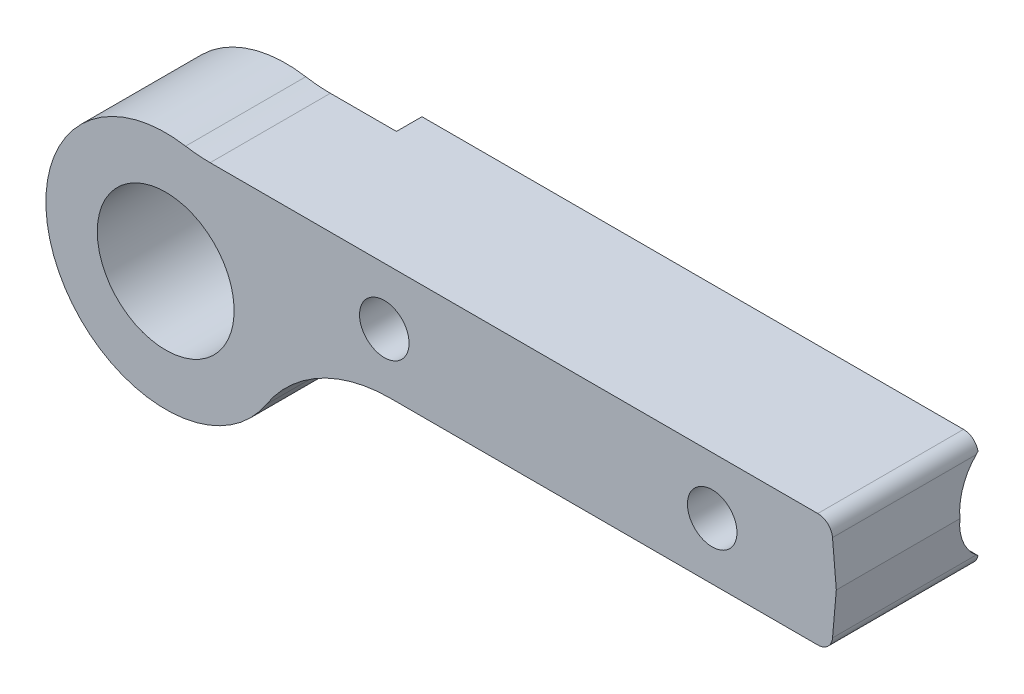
from build123d import *

# Parameters (mm, degrees)
BASE_EXTRUSION_DEPTH    = 20
ESQUISSE3_R             = 22
ENL_V_MAT_EXTRU_1_DEPTH = 3.5
ESQUISSE4_R             = 7.815
ENL_V_MAT_EXTRU_2_DEPTH = 115.413399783
ESQUISSE5_R             = 9.39
ENL_V_MAT_EXTRU_3_DEPTH = 95.936264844
TROU_TARAUD_M8X1_252_D  = 6.8


with BuildPart() as part:
    # Esquisse1 → Base-Extrusion (new body)
    with BuildSketch(Plane.XY):
        with BuildLine():
            Line((6.100803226, 15.935), (89.489847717, 15.935))
            ThreePointArc((89.489847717, 15.935), (90.861295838, 15.401672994), (91.512122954, 14.081926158))
            Line((91.512122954, 14.081926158), (92.033723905, 8.12))
            Line((92.033723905, 8.12), (91.512122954, 2.158073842))
            ThreePointArc((91.512122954, 2.158073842), (90.861295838, 0.838327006), (89.489847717, 0.305))
            Line((89.489847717, 0.305), (30.828477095, 0.305))
            ThreePointArc((30.828477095, 0.305), (21.137014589, -2.157804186), (13.797096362, -8.948639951))
            ThreePointArc((13.797096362, -8.948639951), (-15.053690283, -6.620002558), (2.730377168, 16.216752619))
            ThreePointArc((2.730377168, 16.216752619), (4.409712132, 16.005560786), (6.100803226, 15.935))
        make_face()
    extrude(amount=BASE_EXTRUSION_DEPTH)

    # Esquisse3 → Enl_v. mat.-Extru.1 (cut)
    with BuildSketch(Plane(origin=(0, 0, 0), x_dir=(-1, 0, 0), z_dir=(0, 0, -1))):
        Circle(ESQUISSE3_R)
    extrude(amount=-ENL_V_MAT_EXTRU_1_DEPTH, mode=Mode.SUBTRACT)

    # Esquisse4 → Enl_v. mat.-Extru.2 (cut, through all)
    with BuildSketch(Plane(origin=(95, 0, 0), x_dir=(0, 0, -1), z_dir=(1, 0, 0))):
        with Locations((4.77, 8.12)):
            Circle(ESQUISSE4_R)
    extrude(amount=-ENL_V_MAT_EXTRU_2_DEPTH, mode=Mode.SUBTRACT)

    # Esquisse5 → Enl_v. mat.-Extru.3 (cut, through all)
    with BuildSketch(Plane(origin=(0, 0, 3.5), x_dir=(-1, 0, 0), z_dir=(0, 0, -1))):
        Circle(ESQUISSE5_R)
    extrude(amount=-ENL_V_MAT_EXTRU_3_DEPTH, mode=Mode.SUBTRACT)

    # Trou taraud_ M8x1.252 (through all)
    with Locations(Plane.XY.offset(20)):
        with Locations((30, 8.12), (75, 8.12)):
            Hole(TROU_TARAUD_M8X1_252_D / 2)


solid = part.part
